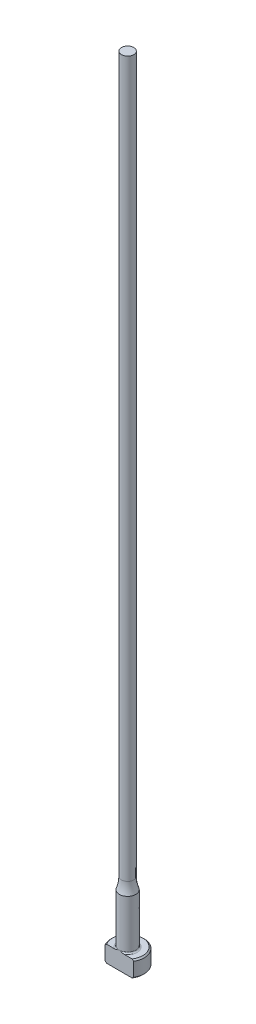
from build123d import *

# Parameters (mm, degrees)
CHAMFER1_SIZE      = 0.254
FILLET1_R          = 0.254
CUT_EXTRUDE1_DEPTH = 153.466131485


with BuildPart() as part:
    # Sketch1 → Revolve1 (revolve)
    with BuildSketch(Plane.XY, mode=Mode.PRIVATE) as revolve1_sk:
        with BuildLine():
            Line((0, 0), (-3.175, 0))
            Line((-3.175, 0), (-3.175, 3.175))
            Line((-3.175, 3.175), (-1.5875, 3.175))
            Line((-1.5875, 3.175), (-1.5875, 12.7))
            ThreePointArc((-1.5875, 12.7), (-1.290157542, 13.787986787), (-1.18999, 14.911416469))
            Line((-1.18999, 14.911416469), (-1.18999, 152.4))
            Line((-1.18999, 152.4), (0, 152.4))
            Line((0, 152.4), (0, 0))
        make_face()
    revolve(revolve1_sk.sketch.rotate(Axis((0, 259.958771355, 0), (0, -1, 0)), 270), axis=Axis((0, 259.958771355, 0), (0, -1, 0)))

    # Chamfer1
    chamfer1_edges = [part.edges().sort_by_distance(p)[0] for p in [
        (0, 0, -3.175),
        (0, 3.175, -3.175),
    ]]
    chamfer(chamfer1_edges, length=CHAMFER1_SIZE)

    # Fillet1
    fillet1_edges = [part.edges().sort_by_distance(p)[0] for p in [
        (0, 3.175, -1.5875),
    ]]
    fillet(fillet1_edges, radius=FILLET1_R)

    # Sketch2 → Cut-Extrude1 (cut, through all)
    with BuildSketch(Plane.XZ):
        with BuildLine():
            Line((-2.749630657, 1.5875), (2.749630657, 1.5875))
            ThreePointArc((2.749630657, 1.5875), (0, 3.175), (-2.749630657, 1.5875))
        make_face()
    extrude(amount=-CUT_EXTRUDE1_DEPTH, mode=Mode.SUBTRACT)


solid = part.part
